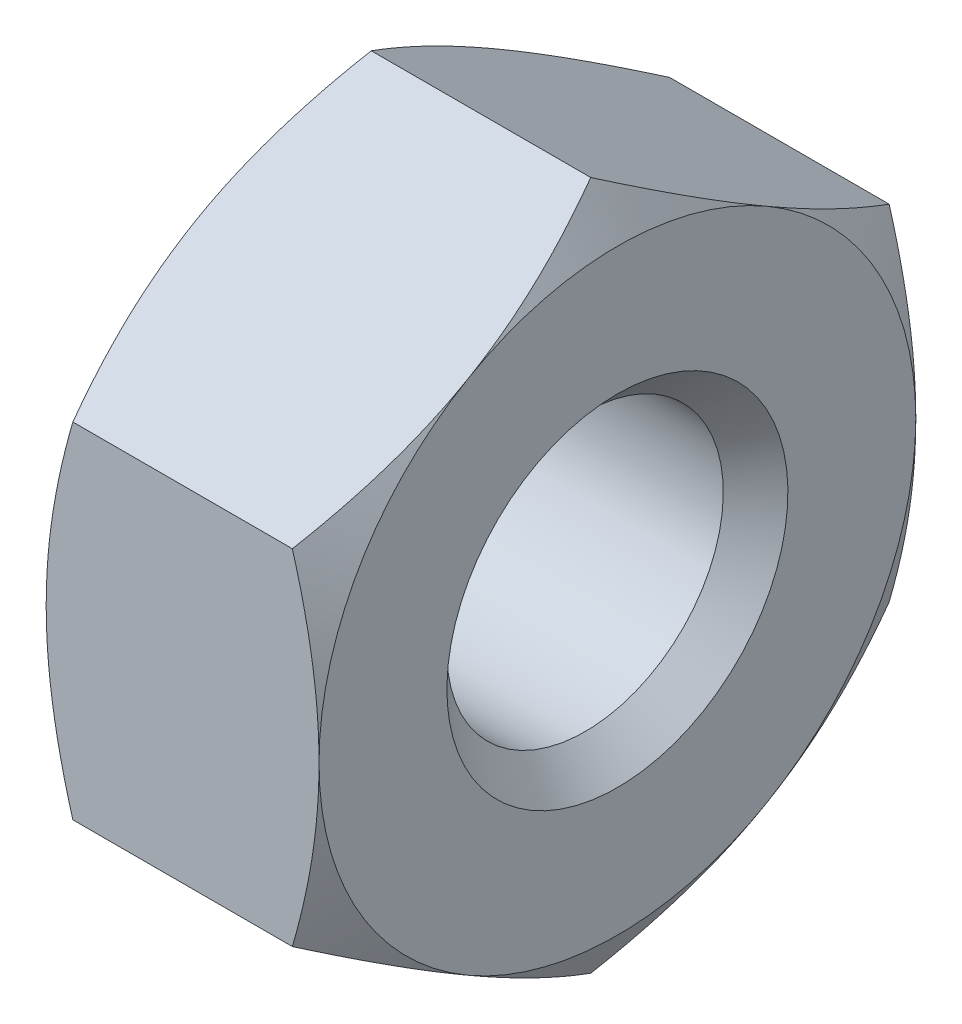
ISO-10303-21;
HEADER;
FILE_DESCRIPTION(('STEP AP214'),'2;1');
FILE_NAME('part.step','',(''),(''),'','','');
FILE_SCHEMA(('AUTOMOTIVE_DESIGN { 1 0 10303 214 1 1 1 1 }'));
ENDSEC;
DATA;
#1=APPLICATION_CONTEXT('core data for automotive mechanical design processes');
#2=APPLICATION_PROTOCOL_DEFINITION('international standard','automotive_design',2000,#1);
#3=PRODUCT_CONTEXT('',#1,'mechanical');
#4=PRODUCT('Part','Part','',(#3));
#5=PRODUCT_RELATED_PRODUCT_CATEGORY('part','',(#4));
#6=PRODUCT_DEFINITION_FORMATION('','',#4);
#7=PRODUCT_DEFINITION_CONTEXT('part definition',#1,'design');
#8=PRODUCT_DEFINITION('design','',#6,#7);
#9=PRODUCT_DEFINITION_SHAPE('','',#8);
#10=(LENGTH_UNIT() NAMED_UNIT(*) SI_UNIT(.MILLI.,.METRE.));
#11=(NAMED_UNIT(*) PLANE_ANGLE_UNIT() SI_UNIT($,.RADIAN.));
#12=(NAMED_UNIT(*) SI_UNIT($,.STERADIAN.) SOLID_ANGLE_UNIT());
#13=UNCERTAINTY_MEASURE_WITH_UNIT(LENGTH_MEASURE(1.E-05),#10,'distance_accuracy_value','');
#14=(GEOMETRIC_REPRESENTATION_CONTEXT(3) GLOBAL_UNCERTAINTY_ASSIGNED_CONTEXT((#13)) GLOBAL_UNIT_ASSIGNED_CONTEXT((#10,
#11,#12)) REPRESENTATION_CONTEXT('',''));
#15=CARTESIAN_POINT('',(0.,0.,0.));
#16=DIRECTION('',(0.,0.,1.));
#17=DIRECTION('',(1.,0.,0.));
#18=AXIS2_PLACEMENT_3D('',#15,#16,#17);
#19=DIRECTION('',(-0.707106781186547,0.707106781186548,0.));
#20=VECTOR('',#19,1.);
#21=CARTESIAN_POINT('',(-498998.,499000.,0.));
#22=LINE('',#21,#20);
#23=CARTESIAN_POINT('',(2.,0.,0.));
#24=DIRECTION('',(-1.,0.,0.));
#25=AXIS1_PLACEMENT('',#23,#24);
#26=SURFACE_OF_REVOLUTION('',#22,#25);
#27=CARTESIAN_POINT('',(0.379,0.,0.));
#28=DIRECTION('',(-1.,0.,0.));
#29=DIRECTION('',(0.,1.,0.));
#30=AXIS2_PLACEMENT_3D('',#27,#28,#29);
#31=CIRCLE('',#30,1.621);
#32=CARTESIAN_POINT('',(0.379,1.621,0.));
#33=VERTEX_POINT('',#32);
#34=EDGE_CURVE('E147',#33,#33,#31,.T.);
#35=ORIENTED_EDGE('',*,*,#34,.F.);
#36=EDGE_LOOP('',(#35));
#37=FACE_BOUND('',#36,.T.);
#38=CARTESIAN_POINT('',(0.,0.,0.));
#39=DIRECTION('',(-1.,0.,0.));
#40=DIRECTION('',(0.,1.,0.));
#41=AXIS2_PLACEMENT_3D('',#38,#39,#40);
#42=CIRCLE('',#41,2.);
#43=CARTESIAN_POINT('',(0.,2.,0.));
#44=VERTEX_POINT('',#43);
#45=EDGE_CURVE('E328',#44,#44,#42,.T.);
#46=ORIENTED_EDGE('',*,*,#45,.T.);
#47=EDGE_LOOP('',(#46));
#48=FACE_BOUND('',#47,.T.);
#49=ADVANCED_FACE('F17',(#37,#48),#26,.F.);
#50=CARTESIAN_POINT('',(0.,2.75,0.));
#51=DIRECTION('',(-1.,0.,0.));
#52=DIRECTION('',(0.,-1.,0.));
#53=AXIS2_PLACEMENT_3D('',#50,#51,#52);
#54=PLANE('',#53);
#55=CARTESIAN_POINT('',(0.,0.,0.));
#56=DIRECTION('',(-1.,0.,0.));
#57=DIRECTION('',(0.,1.,0.));
#58=AXIS2_PLACEMENT_3D('',#55,#56,#57);
#59=CIRCLE('',#58,3.5);
#60=CARTESIAN_POINT('',(0.,3.03108891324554,1.75));
#61=VERTEX_POINT('',#60);
#62=CARTESIAN_POINT('',(0.,3.03108891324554,-1.75));
#63=VERTEX_POINT('',#62);
#64=EDGE_CURVE('E11',#61,#63,#59,.T.);
#65=ORIENTED_EDGE('',*,*,#64,.T.);
#66=CARTESIAN_POINT('',(0.,0.,0.));
#67=DIRECTION('',(-1.,0.,0.));
#68=DIRECTION('',(0.,1.,0.));
#69=AXIS2_PLACEMENT_3D('',#66,#67,#68);
#70=CIRCLE('',#69,3.5);
#71=CARTESIAN_POINT('',(0.,0.,-3.5));
#72=VERTEX_POINT('',#71);
#73=EDGE_CURVE('E27',#63,#72,#70,.T.);
#74=ORIENTED_EDGE('',*,*,#73,.T.);
#75=CARTESIAN_POINT('',(0.,0.,0.));
#76=DIRECTION('',(-1.,0.,0.));
#77=DIRECTION('',(0.,1.,0.));
#78=AXIS2_PLACEMENT_3D('',#75,#76,#77);
#79=CIRCLE('',#78,3.5);
#80=CARTESIAN_POINT('',(0.,-3.03108891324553,-1.75));
#81=VERTEX_POINT('',#80);
#82=EDGE_CURVE('E163',#72,#81,#79,.T.);
#83=ORIENTED_EDGE('',*,*,#82,.T.);
#84=CARTESIAN_POINT('',(0.,0.,0.));
#85=DIRECTION('',(-1.,0.,0.));
#86=DIRECTION('',(0.,1.,0.));
#87=AXIS2_PLACEMENT_3D('',#84,#85,#86);
#88=CIRCLE('',#87,3.5);
#89=CARTESIAN_POINT('',(0.,-3.03108891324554,1.75));
#90=VERTEX_POINT('',#89);
#91=EDGE_CURVE('E169',#81,#90,#88,.T.);
#92=ORIENTED_EDGE('',*,*,#91,.T.);
#93=CARTESIAN_POINT('',(0.,0.,0.));
#94=DIRECTION('',(-1.,0.,0.));
#95=DIRECTION('',(0.,1.,0.));
#96=AXIS2_PLACEMENT_3D('',#93,#94,#95);
#97=CIRCLE('',#96,3.5);
#98=CARTESIAN_POINT('',(0.,0.,3.5));
#99=VERTEX_POINT('',#98);
#100=EDGE_CURVE('E383',#90,#99,#97,.T.);
#101=ORIENTED_EDGE('',*,*,#100,.T.);
#102=CARTESIAN_POINT('',(0.,0.,0.));
#103=DIRECTION('',(-1.,0.,0.));
#104=DIRECTION('',(0.,1.,0.));
#105=AXIS2_PLACEMENT_3D('',#102,#103,#104);
#106=CIRCLE('',#105,3.5);
#107=EDGE_CURVE('E356',#99,#61,#106,.T.);
#108=ORIENTED_EDGE('',*,*,#107,.T.);
#109=EDGE_LOOP('',(#65,#74,#83,#92,#101,#108));
#110=FACE_BOUND('',#109,.T.);
#111=ORIENTED_EDGE('',*,*,#45,.F.);
#112=EDGE_LOOP('',(#111));
#113=FACE_BOUND('',#112,.T.);
#114=ADVANCED_FACE('F193',(#110,#113),#54,.T.);
#115=CARTESIAN_POINT('',(3.2,2.75,0.));
#116=DIRECTION('',(1.,0.,0.));
#117=DIRECTION('',(0.,0.,-1.));
#118=AXIS2_PLACEMENT_3D('',#115,#116,#117);
#119=PLANE('',#118);
#120=CARTESIAN_POINT('',(3.2,0.,0.));
#121=DIRECTION('',(-1.,0.,0.));
#122=DIRECTION('',(0.,1.,0.));
#123=AXIS2_PLACEMENT_3D('',#120,#121,#122);
#124=CIRCLE('',#123,2.);
#125=CARTESIAN_POINT('',(3.2,2.,0.));
#126=VERTEX_POINT('',#125);
#127=EDGE_CURVE('E376',#126,#126,#124,.T.);
#128=ORIENTED_EDGE('',*,*,#127,.T.);
#129=EDGE_LOOP('',(#128));
#130=FACE_BOUND('',#129,.T.);
#131=CARTESIAN_POINT('',(3.2,0.,0.));
#132=DIRECTION('',(-1.,0.,0.));
#133=DIRECTION('',(0.,1.,0.));
#134=AXIS2_PLACEMENT_3D('',#131,#132,#133);
#135=CIRCLE('',#134,3.5);
#136=CARTESIAN_POINT('',(3.2,3.03108891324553,1.75));
#137=VERTEX_POINT('',#136);
#138=CARTESIAN_POINT('',(3.2,3.03108891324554,-1.75));
#139=VERTEX_POINT('',#138);
#140=EDGE_CURVE('E129',#137,#139,#135,.T.);
#141=ORIENTED_EDGE('',*,*,#140,.F.);
#142=CARTESIAN_POINT('',(3.2,0.,0.));
#143=DIRECTION('',(-1.,0.,0.));
#144=DIRECTION('',(0.,1.,0.));
#145=AXIS2_PLACEMENT_3D('',#142,#143,#144);
#146=CIRCLE('',#145,3.5);
#147=CARTESIAN_POINT('',(3.2,0.,3.5));
#148=VERTEX_POINT('',#147);
#149=EDGE_CURVE('E133',#148,#137,#146,.T.);
#150=ORIENTED_EDGE('',*,*,#149,.F.);
#151=CARTESIAN_POINT('',(3.2,0.,0.));
#152=DIRECTION('',(-1.,0.,0.));
#153=DIRECTION('',(0.,1.,0.));
#154=AXIS2_PLACEMENT_3D('',#151,#152,#153);
#155=CIRCLE('',#154,3.5);
#156=CARTESIAN_POINT('',(3.2,-3.03108891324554,1.75));
#157=VERTEX_POINT('',#156);
#158=EDGE_CURVE('E80',#157,#148,#155,.T.);
#159=ORIENTED_EDGE('',*,*,#158,.F.);
#160=CARTESIAN_POINT('',(3.2,0.,0.));
#161=DIRECTION('',(-1.,0.,0.));
#162=DIRECTION('',(0.,1.,0.));
#163=AXIS2_PLACEMENT_3D('',#160,#161,#162);
#164=CIRCLE('',#163,3.5);
#165=CARTESIAN_POINT('',(3.2,-3.03108891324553,-1.75));
#166=VERTEX_POINT('',#165);
#167=EDGE_CURVE('E86',#166,#157,#164,.T.);
#168=ORIENTED_EDGE('',*,*,#167,.F.);
#169=CARTESIAN_POINT('',(3.2,0.,0.));
#170=DIRECTION('',(-1.,0.,0.));
#171=DIRECTION('',(0.,1.,0.));
#172=AXIS2_PLACEMENT_3D('',#169,#170,#171);
#173=CIRCLE('',#172,3.5);
#174=CARTESIAN_POINT('',(3.2,0.,-3.5));
#175=VERTEX_POINT('',#174);
#176=EDGE_CURVE('E152',#175,#166,#173,.T.);
#177=ORIENTED_EDGE('',*,*,#176,.F.);
#178=CARTESIAN_POINT('',(3.2,0.,0.));
#179=DIRECTION('',(-1.,0.,0.));
#180=DIRECTION('',(0.,1.,0.));
#181=AXIS2_PLACEMENT_3D('',#178,#179,#180);
#182=CIRCLE('',#181,3.5);
#183=EDGE_CURVE('E408',#139,#175,#182,.T.);
#184=ORIENTED_EDGE('',*,*,#183,.F.);
#185=EDGE_LOOP('',(#141,#150,#159,#168,#177,#184));
#186=FACE_BOUND('',#185,.T.);
#187=ADVANCED_FACE('F197',(#130,#186),#119,.T.);
#188=DIRECTION('',(0.707106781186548,0.707106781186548,0.));
#189=VECTOR('',#188,1.);
#190=CARTESIAN_POINT('',(499000.,498998.8,0.));
#191=LINE('',#190,#189);
#192=CARTESIAN_POINT('',(1.2,0.,0.));
#193=DIRECTION('',(1.,0.,0.));
#194=AXIS1_PLACEMENT('',#192,#193);
#195=SURFACE_OF_REVOLUTION('',#191,#194);
#196=ORIENTED_EDGE('',*,*,#127,.F.);
#197=EDGE_LOOP('',(#196));
#198=FACE_BOUND('',#197,.T.);
#199=CARTESIAN_POINT('',(2.821,0.,0.));
#200=DIRECTION('',(-1.,0.,0.));
#201=DIRECTION('',(0.,1.,0.));
#202=AXIS2_PLACEMENT_3D('',#199,#200,#201);
#203=CIRCLE('',#202,1.621);
#204=CARTESIAN_POINT('',(2.821,1.621,0.));
#205=VERTEX_POINT('',#204);
#206=EDGE_CURVE('E341',#205,#205,#203,.T.);
#207=ORIENTED_EDGE('',*,*,#206,.T.);
#208=EDGE_LOOP('',(#207));
#209=FACE_BOUND('',#208,.T.);
#210=ADVANCED_FACE('F201',(#198,#209),#195,.F.);
#211=CARTESIAN_POINT('',(1.6,0.,0.));
#212=DIRECTION('',(1.,0.,0.));
#213=DIRECTION('',(0.,1.,0.));
#214=AXIS2_PLACEMENT_3D('',#211,#212,#213);
#215=CIRCLE('',#214,1.621);
#216=DIRECTION('',(-1.,0.,0.));
#217=VECTOR('',#216,1.);
#218=SURFACE_OF_LINEAR_EXTRUSION('',#215,#217);
#219=ORIENTED_EDGE('',*,*,#206,.F.);
#220=EDGE_LOOP('',(#219));
#221=FACE_BOUND('',#220,.T.);
#222=ORIENTED_EDGE('',*,*,#34,.T.);
#223=EDGE_LOOP('',(#222));
#224=FACE_BOUND('',#223,.T.);
#225=ADVANCED_FACE('F205',(#221,#224),#218,.T.);
#226=DIRECTION('',(0.5,-0.866025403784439,0.));
#227=VECTOR('',#226,1.);
#228=CARTESIAN_POINT('',(-288092.563599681,499000.,0.));
#229=LINE('',#228,#227);
#230=CARTESIAN_POINT('',(5.22072594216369,0.,0.));
#231=DIRECTION('',(-1.,0.,0.));
#232=AXIS1_PLACEMENT('',#230,#231);
#233=SURFACE_OF_REVOLUTION('',#229,#232);
#234=CARTESIAN_POINT('',(3.2,3.03108891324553,1.75));
#235=CARTESIAN_POINT('',(3.2,2.5621778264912,2.56217782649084));
#236=CARTESIAN_POINT('',(2.88739260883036,2.02072594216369,3.5));
#237=(BOUNDED_CURVE() B_SPLINE_CURVE(2,(#234,#235,#236),.UNSPECIFIED.,.F.,
.F.) B_SPLINE_CURVE_WITH_KNOTS((3,3),(5.47756078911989,8.00558104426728),
.UNSPECIFIED.) CURVE() GEOMETRIC_REPRESENTATION_ITEM() RATIONAL_B_SPLINE_CURVE((1.,
1.08375764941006,1.09020313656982)) REPRESENTATION_ITEM(''));
#238=CARTESIAN_POINT('',(2.88739260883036,2.02072594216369,3.5));
#239=VERTEX_POINT('',#238);
#240=EDGE_CURVE('E125',#137,#239,#237,.T.);
#241=ORIENTED_EDGE('',*,*,#240,.T.);
#242=CARTESIAN_POINT('',(2.88739260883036,2.02072594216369,3.5));
#243=CARTESIAN_POINT('',(3.2,0.937822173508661,3.5));
#244=CARTESIAN_POINT('',(3.2,0.,3.5));
#245=(BOUNDED_CURVE() B_SPLINE_CURVE(2,(#242,#243,#244),.UNSPECIFIED.,.F.,
.F.) B_SPLINE_CURVE_WITH_KNOTS((3,3),(2.94954053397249,5.47756078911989),
.UNSPECIFIED.) CURVE() GEOMETRIC_REPRESENTATION_ITEM() RATIONAL_B_SPLINE_CURVE((1.09020313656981,
1.08375764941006,1.)) REPRESENTATION_ITEM(''));
#246=EDGE_CURVE('E135',#239,#148,#245,.T.);
#247=ORIENTED_EDGE('',*,*,#246,.T.);
#248=ORIENTED_EDGE('',*,*,#149,.T.);
#249=EDGE_LOOP('',(#241,#247,#248));
#250=FACE_BOUND('',#249,.T.);
#251=ADVANCED_FACE('F209',(#250),#233,.F.);
#252=DIRECTION('',(0.5,-0.866025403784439,0.));
#253=VECTOR('',#252,1.);
#254=CARTESIAN_POINT('',(-288092.563599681,499000.,0.));
#255=LINE('',#254,#253);
#256=CARTESIAN_POINT('',(5.22072594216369,0.,0.));
#257=DIRECTION('',(-1.,0.,0.));
#258=AXIS1_PLACEMENT('',#256,#257);
#259=SURFACE_OF_REVOLUTION('',#255,#258);
#260=CARTESIAN_POINT('',(3.2,3.03108891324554,-1.75));
#261=CARTESIAN_POINT('',(3.2,3.49999999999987,-0.93782217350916));
#262=CARTESIAN_POINT('',(2.88739260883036,4.04145188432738,0.));
#263=(BOUNDED_CURVE() B_SPLINE_CURVE(2,(#260,#261,#262),.UNSPECIFIED.,.F.,
.F.) B_SPLINE_CURVE_WITH_KNOTS((3,3),(5.47756078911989,8.00558104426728),
.UNSPECIFIED.) CURVE() GEOMETRIC_REPRESENTATION_ITEM() RATIONAL_B_SPLINE_CURVE((1.,
1.08375764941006,1.09020313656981)) REPRESENTATION_ITEM(''));
#264=CARTESIAN_POINT('',(2.88739260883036,4.04145188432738,0.));
#265=VERTEX_POINT('',#264);
#266=EDGE_CURVE('E111',#139,#265,#263,.T.);
#267=ORIENTED_EDGE('',*,*,#266,.T.);
#268=CARTESIAN_POINT('',(2.88739260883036,4.04145188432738,0.));
#269=CARTESIAN_POINT('',(3.2,3.49999999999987,0.937822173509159));
#270=CARTESIAN_POINT('',(3.2,3.03108891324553,1.75));
#271=(BOUNDED_CURVE() B_SPLINE_CURVE(2,(#268,#269,#270),.UNSPECIFIED.,.F.,
.F.) B_SPLINE_CURVE_WITH_KNOTS((3,3),(2.94954053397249,5.47756078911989),
.UNSPECIFIED.) CURVE() GEOMETRIC_REPRESENTATION_ITEM() RATIONAL_B_SPLINE_CURVE((1.09020313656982,
1.08375764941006,1.)) REPRESENTATION_ITEM(''));
#272=EDGE_CURVE('E121',#265,#137,#271,.T.);
#273=ORIENTED_EDGE('',*,*,#272,.T.);
#274=ORIENTED_EDGE('',*,*,#140,.T.);
#275=EDGE_LOOP('',(#267,#273,#274));
#276=FACE_BOUND('',#275,.T.);
#277=ADVANCED_FACE('F131',(#276),#259,.F.);
#278=DIRECTION('',(0.5,-0.866025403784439,0.));
#279=VECTOR('',#278,1.);
#280=CARTESIAN_POINT('',(-288092.563599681,499000.,0.));
#281=LINE('',#280,#279);
#282=CARTESIAN_POINT('',(5.22072594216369,0.,0.));
#283=DIRECTION('',(-1.,0.,0.));
#284=AXIS1_PLACEMENT('',#282,#283);
#285=SURFACE_OF_REVOLUTION('',#281,#284);
#286=CARTESIAN_POINT('',(3.2,0.,-3.5));
#287=CARTESIAN_POINT('',(3.2,0.93782217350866,-3.5));
#288=CARTESIAN_POINT('',(2.88739260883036,2.02072594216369,-3.5));
#289=(BOUNDED_CURVE() B_SPLINE_CURVE(2,(#286,#287,#288),.UNSPECIFIED.,.F.,
.F.) B_SPLINE_CURVE_WITH_KNOTS((3,3),(5.47756078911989,8.00558104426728),
.UNSPECIFIED.) CURVE() GEOMETRIC_REPRESENTATION_ITEM() RATIONAL_B_SPLINE_CURVE((1.,
1.08375764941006,1.09020313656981)) REPRESENTATION_ITEM(''));
#290=CARTESIAN_POINT('',(2.88739260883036,2.02072594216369,-3.5));
#291=VERTEX_POINT('',#290);
#292=EDGE_CURVE('E409',#175,#291,#289,.T.);
#293=ORIENTED_EDGE('',*,*,#292,.T.);
#294=CARTESIAN_POINT('',(2.88739260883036,2.02072594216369,-3.5));
#295=CARTESIAN_POINT('',(3.2,2.56217782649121,-2.56217782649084));
#296=CARTESIAN_POINT('',(3.2,3.03108891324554,-1.75));
#297=(BOUNDED_CURVE() B_SPLINE_CURVE(2,(#294,#295,#296),.UNSPECIFIED.,.F.,
.F.) B_SPLINE_CURVE_WITH_KNOTS((3,3),(2.94954053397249,5.47756078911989),
.UNSPECIFIED.) CURVE() GEOMETRIC_REPRESENTATION_ITEM() RATIONAL_B_SPLINE_CURVE((1.09020313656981,
1.08375764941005,1.)) REPRESENTATION_ITEM(''));
#298=EDGE_CURVE('E103',#291,#139,#297,.T.);
#299=ORIENTED_EDGE('',*,*,#298,.T.);
#300=ORIENTED_EDGE('',*,*,#183,.T.);
#301=EDGE_LOOP('',(#293,#299,#300));
#302=FACE_BOUND('',#301,.T.);
#303=ADVANCED_FACE('F222',(#302),#285,.F.);
#304=DIRECTION('',(0.5,-0.866025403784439,0.));
#305=VECTOR('',#304,1.);
#306=CARTESIAN_POINT('',(-288092.563599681,499000.,0.));
#307=LINE('',#306,#305);
#308=CARTESIAN_POINT('',(5.22072594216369,0.,0.));
#309=DIRECTION('',(-1.,0.,0.));
#310=AXIS1_PLACEMENT('',#308,#309);
#311=SURFACE_OF_REVOLUTION('',#307,#310);
#312=CARTESIAN_POINT('',(2.88739260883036,-2.02072594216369,-3.5));
#313=CARTESIAN_POINT('',(3.2,-0.937822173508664,-3.5));
#314=CARTESIAN_POINT('',(3.2,0.,-3.5));
#315=(BOUNDED_CURVE() B_SPLINE_CURVE(2,(#312,#313,#314),.UNSPECIFIED.,.F.,
.F.) B_SPLINE_CURVE_WITH_KNOTS((3,3),(2.94954053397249,5.47756078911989),
.UNSPECIFIED.) CURVE() GEOMETRIC_REPRESENTATION_ITEM() RATIONAL_B_SPLINE_CURVE((1.09020313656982,
1.08375764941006,1.)) REPRESENTATION_ITEM(''));
#316=CARTESIAN_POINT('',(2.88739260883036,-2.02072594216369,-3.5));
#317=VERTEX_POINT('',#316);
#318=EDGE_CURVE('E401',#317,#175,#315,.T.);
#319=ORIENTED_EDGE('',*,*,#318,.T.);
#320=ORIENTED_EDGE('',*,*,#176,.T.);
#321=CARTESIAN_POINT('',(3.2,-3.03108891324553,-1.75));
#322=CARTESIAN_POINT('',(3.2,-2.5621778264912,-2.56217782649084));
#323=CARTESIAN_POINT('',(2.88739260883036,-2.02072594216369,-3.5));
#324=(BOUNDED_CURVE() B_SPLINE_CURVE(2,(#321,#322,#323),.UNSPECIFIED.,.F.,
.F.) B_SPLINE_CURVE_WITH_KNOTS((3,3),(5.47756078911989,8.00558104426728),
.UNSPECIFIED.) CURVE() GEOMETRIC_REPRESENTATION_ITEM() RATIONAL_B_SPLINE_CURVE((1.,
1.08375764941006,1.09020313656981)) REPRESENTATION_ITEM(''));
#325=EDGE_CURVE('E148',#166,#317,#324,.T.);
#326=ORIENTED_EDGE('',*,*,#325,.T.);
#327=EDGE_LOOP('',(#319,#320,#326));
#328=FACE_BOUND('',#327,.T.);
#329=ADVANCED_FACE('F225',(#328),#311,.F.);
#330=DIRECTION('',(0.5,-0.866025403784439,0.));
#331=VECTOR('',#330,1.);
#332=CARTESIAN_POINT('',(-288092.563599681,499000.,0.));
#333=LINE('',#332,#331);
#334=CARTESIAN_POINT('',(5.22072594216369,0.,0.));
#335=DIRECTION('',(-1.,0.,0.));
#336=AXIS1_PLACEMENT('',#334,#335);
#337=SURFACE_OF_REVOLUTION('',#333,#336);
#338=CARTESIAN_POINT('',(2.88739260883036,-4.04145188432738,0.));
#339=CARTESIAN_POINT('',(3.2,-3.49999999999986,-0.937822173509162));
#340=CARTESIAN_POINT('',(3.2,-3.03108891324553,-1.75));
#341=(BOUNDED_CURVE() B_SPLINE_CURVE(2,(#338,#339,#340),.UNSPECIFIED.,.F.,
.F.) B_SPLINE_CURVE_WITH_KNOTS((3,3),(2.9495405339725,5.47756078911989),
.UNSPECIFIED.) CURVE() GEOMETRIC_REPRESENTATION_ITEM() RATIONAL_B_SPLINE_CURVE((1.09020313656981,
1.08375764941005,1.)) REPRESENTATION_ITEM(''));
#342=CARTESIAN_POINT('',(2.88739260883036,-4.04145188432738,0.));
#343=VERTEX_POINT('',#342);
#344=EDGE_CURVE('E153',#343,#166,#341,.T.);
#345=ORIENTED_EDGE('',*,*,#344,.T.);
#346=ORIENTED_EDGE('',*,*,#167,.T.);
#347=CARTESIAN_POINT('',(3.2,-3.03108891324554,1.75));
#348=CARTESIAN_POINT('',(3.2,-3.49999999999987,0.937822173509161));
#349=CARTESIAN_POINT('',(2.88739260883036,-4.04145188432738,0.));
#350=(BOUNDED_CURVE() B_SPLINE_CURVE(2,(#347,#348,#349),.UNSPECIFIED.,.F.,
.F.) B_SPLINE_CURVE_WITH_KNOTS((3,3),(5.47756078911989,8.00558104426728),
.UNSPECIFIED.) CURVE() GEOMETRIC_REPRESENTATION_ITEM() RATIONAL_B_SPLINE_CURVE((1.,
1.08375764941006,1.09020313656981)) REPRESENTATION_ITEM(''));
#351=EDGE_CURVE('E162',#157,#343,#350,.T.);
#352=ORIENTED_EDGE('',*,*,#351,.T.);
#353=EDGE_LOOP('',(#345,#346,#352));
#354=FACE_BOUND('',#353,.T.);
#355=ADVANCED_FACE('F229',(#354),#337,.F.);
#356=DIRECTION('',(0.5,-0.866025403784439,0.));
#357=VECTOR('',#356,1.);
#358=CARTESIAN_POINT('',(-288092.563599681,499000.,0.));
#359=LINE('',#358,#357);
#360=CARTESIAN_POINT('',(5.22072594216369,0.,0.));
#361=DIRECTION('',(-1.,0.,0.));
#362=AXIS1_PLACEMENT('',#360,#361);
#363=SURFACE_OF_REVOLUTION('',#359,#362);
#364=CARTESIAN_POINT('',(2.88739260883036,-2.02072594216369,3.5));
#365=CARTESIAN_POINT('',(3.2,-2.5621778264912,2.56217782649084));
#366=CARTESIAN_POINT('',(3.2,-3.03108891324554,1.75));
#367=(BOUNDED_CURVE() B_SPLINE_CURVE(2,(#364,#365,#366),.UNSPECIFIED.,.F.,
.F.) B_SPLINE_CURVE_WITH_KNOTS((3,3),(2.94954053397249,5.47756078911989),
.UNSPECIFIED.) CURVE() GEOMETRIC_REPRESENTATION_ITEM() RATIONAL_B_SPLINE_CURVE((1.09020313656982,
1.08375764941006,1.)) REPRESENTATION_ITEM(''));
#368=CARTESIAN_POINT('',(2.88739260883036,-2.02072594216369,3.5));
#369=VERTEX_POINT('',#368);
#370=EDGE_CURVE('E154',#369,#157,#367,.T.);
#371=ORIENTED_EDGE('',*,*,#370,.T.);
#372=ORIENTED_EDGE('',*,*,#158,.T.);
#373=CARTESIAN_POINT('',(3.2,0.,3.5));
#374=CARTESIAN_POINT('',(3.2,-0.937822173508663,3.5));
#375=CARTESIAN_POINT('',(2.88739260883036,-2.02072594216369,3.5));
#376=(BOUNDED_CURVE() B_SPLINE_CURVE(2,(#373,#374,#375),.UNSPECIFIED.,.F.,
.F.) B_SPLINE_CURVE_WITH_KNOTS((3,3),(5.47756078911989,8.00558104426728),
.UNSPECIFIED.) CURVE() GEOMETRIC_REPRESENTATION_ITEM() RATIONAL_B_SPLINE_CURVE((1.,
1.08375764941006,1.09020313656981)) REPRESENTATION_ITEM(''));
#377=EDGE_CURVE('E429',#148,#369,#376,.T.);
#378=ORIENTED_EDGE('',*,*,#377,.T.);
#379=EDGE_LOOP('',(#371,#372,#378));
#380=FACE_BOUND('',#379,.T.);
#381=ADVANCED_FACE('F240',(#380),#363,.F.);
#382=DIRECTION('',(-0.5,-0.866025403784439,0.));
#383=VECTOR('',#382,1.);
#384=CARTESIAN_POINT('',(288095.763599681,499000.,0.));
#385=LINE('',#384,#383);
#386=CARTESIAN_POINT('',(-2.02072594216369,0.,0.));
#387=DIRECTION('',(1.,0.,0.));
#388=AXIS1_PLACEMENT('',#386,#387);
#389=SURFACE_OF_REVOLUTION('',#385,#388);
#390=CARTESIAN_POINT('',(0.,3.03108891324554,1.75));
#391=CARTESIAN_POINT('',(0.,3.49999999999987,0.937822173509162));
#392=CARTESIAN_POINT('',(0.312607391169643,4.04145188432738,0.));
#393=(BOUNDED_CURVE() B_SPLINE_CURVE(2,(#390,#391,#392),.UNSPECIFIED.,.F.,
.F.) B_SPLINE_CURVE_WITH_KNOTS((3,3),(5.47756078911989,8.00558104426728),
.UNSPECIFIED.) CURVE() GEOMETRIC_REPRESENTATION_ITEM() RATIONAL_B_SPLINE_CURVE((1.,
1.08375764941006,1.09020313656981)) REPRESENTATION_ITEM(''));
#394=CARTESIAN_POINT('',(0.312607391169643,4.04145188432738,0.));
#395=VERTEX_POINT('',#394);
#396=EDGE_CURVE('E326',#61,#395,#393,.T.);
#397=ORIENTED_EDGE('',*,*,#396,.T.);
#398=CARTESIAN_POINT('',(0.312607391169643,4.04145188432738,0.));
#399=CARTESIAN_POINT('',(0.,3.49999999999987,-0.937822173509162));
#400=CARTESIAN_POINT('',(0.,3.03108891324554,-1.75));
#401=(BOUNDED_CURVE() B_SPLINE_CURVE(2,(#398,#399,#400),.UNSPECIFIED.,.F.,
.F.) B_SPLINE_CURVE_WITH_KNOTS((3,3),(2.9495405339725,5.47756078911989),
.UNSPECIFIED.) CURVE() GEOMETRIC_REPRESENTATION_ITEM() RATIONAL_B_SPLINE_CURVE((1.09020313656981,
1.08375764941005,1.)) REPRESENTATION_ITEM(''));
#402=EDGE_CURVE('E112',#395,#63,#401,.T.);
#403=ORIENTED_EDGE('',*,*,#402,.T.);
#404=ORIENTED_EDGE('',*,*,#64,.F.);
#405=EDGE_LOOP('',(#397,#403,#404));
#406=FACE_BOUND('',#405,.T.);
#407=ADVANCED_FACE('F243',(#406),#389,.F.);
#408=DIRECTION('',(-0.5,-0.866025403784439,0.));
#409=VECTOR('',#408,1.);
#410=CARTESIAN_POINT('',(288095.763599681,499000.,0.));
#411=LINE('',#410,#409);
#412=CARTESIAN_POINT('',(-2.02072594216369,0.,0.));
#413=DIRECTION('',(1.,0.,0.));
#414=AXIS1_PLACEMENT('',#412,#413);
#415=SURFACE_OF_REVOLUTION('',#411,#414);
#416=CARTESIAN_POINT('',(0.,0.,3.5));
#417=CARTESIAN_POINT('',(0.,0.937822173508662,3.5));
#418=CARTESIAN_POINT('',(0.312607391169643,2.02072594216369,3.5));
#419=(BOUNDED_CURVE() B_SPLINE_CURVE(2,(#416,#417,#418),.UNSPECIFIED.,.F.,
.F.) B_SPLINE_CURVE_WITH_KNOTS((3,3),(5.47756078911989,8.00558104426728),
.UNSPECIFIED.) CURVE() GEOMETRIC_REPRESENTATION_ITEM() RATIONAL_B_SPLINE_CURVE((1.,
1.08375764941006,1.09020313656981)) REPRESENTATION_ITEM(''));
#420=CARTESIAN_POINT('',(0.312607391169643,2.02072594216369,3.5));
#421=VERTEX_POINT('',#420);
#422=EDGE_CURVE('E327',#99,#421,#419,.T.);
#423=ORIENTED_EDGE('',*,*,#422,.T.);
#424=CARTESIAN_POINT('',(0.312607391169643,2.02072594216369,3.5));
#425=CARTESIAN_POINT('',(0.,2.5621778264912,2.56217782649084));
#426=CARTESIAN_POINT('',(0.,3.03108891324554,1.75));
#427=(BOUNDED_CURVE() B_SPLINE_CURVE(2,(#424,#425,#426),.UNSPECIFIED.,.F.,
.F.) B_SPLINE_CURVE_WITH_KNOTS((3,3),(2.9495405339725,5.47756078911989),
.UNSPECIFIED.) CURVE() GEOMETRIC_REPRESENTATION_ITEM() RATIONAL_B_SPLINE_CURVE((1.09020313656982,
1.08375764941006,1.)) REPRESENTATION_ITEM(''));
#428=EDGE_CURVE('E351',#421,#61,#427,.T.);
#429=ORIENTED_EDGE('',*,*,#428,.T.);
#430=ORIENTED_EDGE('',*,*,#107,.F.);
#431=EDGE_LOOP('',(#423,#429,#430));
#432=FACE_BOUND('',#431,.T.);
#433=ADVANCED_FACE('F247',(#432),#415,.F.);
#434=DIRECTION('',(-0.5,-0.866025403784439,0.));
#435=VECTOR('',#434,1.);
#436=CARTESIAN_POINT('',(288095.763599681,499000.,0.));
#437=LINE('',#436,#435);
#438=CARTESIAN_POINT('',(-2.02072594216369,0.,0.));
#439=DIRECTION('',(1.,0.,0.));
#440=AXIS1_PLACEMENT('',#438,#439);
#441=SURFACE_OF_REVOLUTION('',#437,#440);
#442=CARTESIAN_POINT('',(0.,-3.03108891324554,1.75));
#443=CARTESIAN_POINT('',(0.,-2.5621778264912,2.56217782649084));
#444=CARTESIAN_POINT('',(0.312607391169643,-2.02072594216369,3.5));
#445=(BOUNDED_CURVE() B_SPLINE_CURVE(2,(#442,#443,#444),.UNSPECIFIED.,.F.,
.F.) B_SPLINE_CURVE_WITH_KNOTS((3,3),(5.47756078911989,8.00558104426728),
.UNSPECIFIED.) CURVE() GEOMETRIC_REPRESENTATION_ITEM() RATIONAL_B_SPLINE_CURVE((1.,
1.08375764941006,1.09020313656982)) REPRESENTATION_ITEM(''));
#446=CARTESIAN_POINT('',(0.312607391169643,-2.02072594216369,3.5));
#447=VERTEX_POINT('',#446);
#448=EDGE_CURVE('E296',#90,#447,#445,.T.);
#449=ORIENTED_EDGE('',*,*,#448,.T.);
#450=CARTESIAN_POINT('',(0.312607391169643,-2.02072594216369,3.5));
#451=CARTESIAN_POINT('',(0.,-0.937822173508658,3.5));
#452=CARTESIAN_POINT('',(0.,0.,3.5));
#453=(BOUNDED_CURVE() B_SPLINE_CURVE(2,(#450,#451,#452),.UNSPECIFIED.,.F.,
.F.) B_SPLINE_CURVE_WITH_KNOTS((3,3),(2.9495405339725,5.47756078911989),
.UNSPECIFIED.) CURVE() GEOMETRIC_REPRESENTATION_ITEM() RATIONAL_B_SPLINE_CURVE((1.09020313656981,
1.08375764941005,1.)) REPRESENTATION_ITEM(''));
#454=EDGE_CURVE('E181',#447,#99,#453,.T.);
#455=ORIENTED_EDGE('',*,*,#454,.T.);
#456=ORIENTED_EDGE('',*,*,#100,.F.);
#457=EDGE_LOOP('',(#449,#455,#456));
#458=FACE_BOUND('',#457,.T.);
#459=ADVANCED_FACE('F251',(#458),#441,.F.);
#460=DIRECTION('',(-0.5,-0.866025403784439,0.));
#461=VECTOR('',#460,1.);
#462=CARTESIAN_POINT('',(288095.763599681,499000.,0.));
#463=LINE('',#462,#461);
#464=CARTESIAN_POINT('',(-2.02072594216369,0.,0.));
#465=DIRECTION('',(1.,0.,0.));
#466=AXIS1_PLACEMENT('',#464,#465);
#467=SURFACE_OF_REVOLUTION('',#463,#466);
#468=CARTESIAN_POINT('',(0.312607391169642,-4.04145188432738,0.));
#469=CARTESIAN_POINT('',(0.,-3.49999999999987,0.937822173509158));
#470=CARTESIAN_POINT('',(0.,-3.03108891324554,1.75));
#471=(BOUNDED_CURVE() B_SPLINE_CURVE(2,(#468,#469,#470),.UNSPECIFIED.,.F.,
.F.) B_SPLINE_CURVE_WITH_KNOTS((3,3),(2.9495405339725,5.47756078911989),
.UNSPECIFIED.) CURVE() GEOMETRIC_REPRESENTATION_ITEM() RATIONAL_B_SPLINE_CURVE((1.09020313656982,
1.08375764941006,1.)) REPRESENTATION_ITEM(''));
#472=CARTESIAN_POINT('',(0.312607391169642,-4.04145188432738,0.));
#473=VERTEX_POINT('',#472);
#474=EDGE_CURVE('E176',#473,#90,#471,.T.);
#475=ORIENTED_EDGE('',*,*,#474,.T.);
#476=ORIENTED_EDGE('',*,*,#91,.F.);
#477=CARTESIAN_POINT('',(0.,-3.03108891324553,-1.75));
#478=CARTESIAN_POINT('',(0.,-3.49999999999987,-0.937822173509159));
#479=CARTESIAN_POINT('',(0.312607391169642,-4.04145188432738,0.));
#480=(BOUNDED_CURVE() B_SPLINE_CURVE(2,(#477,#478,#479),.UNSPECIFIED.,.F.,
.F.) B_SPLINE_CURVE_WITH_KNOTS((3,3),(5.47756078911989,8.00558104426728),
.UNSPECIFIED.) CURVE() GEOMETRIC_REPRESENTATION_ITEM() RATIONAL_B_SPLINE_CURVE((1.,
1.08375764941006,1.09020313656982)) REPRESENTATION_ITEM(''));
#481=EDGE_CURVE('E182',#81,#473,#480,.T.);
#482=ORIENTED_EDGE('',*,*,#481,.T.);
#483=EDGE_LOOP('',(#475,#476,#482));
#484=FACE_BOUND('',#483,.T.);
#485=ADVANCED_FACE('F260',(#484),#467,.F.);
#486=DIRECTION('',(-0.5,-0.866025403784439,0.));
#487=VECTOR('',#486,1.);
#488=CARTESIAN_POINT('',(288095.763599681,499000.,0.));
#489=LINE('',#488,#487);
#490=CARTESIAN_POINT('',(-2.02072594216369,0.,0.));
#491=DIRECTION('',(1.,0.,0.));
#492=AXIS1_PLACEMENT('',#490,#491);
#493=SURFACE_OF_REVOLUTION('',#489,#492);
#494=CARTESIAN_POINT('',(0.312607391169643,-2.02072594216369,-3.5));
#495=CARTESIAN_POINT('',(0.,-2.5621778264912,-2.56217782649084));
#496=CARTESIAN_POINT('',(0.,-3.03108891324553,-1.75));
#497=(BOUNDED_CURVE() B_SPLINE_CURVE(2,(#494,#495,#496),.UNSPECIFIED.,.F.,
.F.) B_SPLINE_CURVE_WITH_KNOTS((3,3),(2.94954053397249,5.47756078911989),
.UNSPECIFIED.) CURVE() GEOMETRIC_REPRESENTATION_ITEM() RATIONAL_B_SPLINE_CURVE((1.09020313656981,
1.08375764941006,1.)) REPRESENTATION_ITEM(''));
#498=CARTESIAN_POINT('',(0.312607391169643,-2.02072594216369,-3.5));
#499=VERTEX_POINT('',#498);
#500=EDGE_CURVE('E303',#499,#81,#497,.T.);
#501=ORIENTED_EDGE('',*,*,#500,.T.);
#502=ORIENTED_EDGE('',*,*,#82,.F.);
#503=CARTESIAN_POINT('',(0.,0.,-3.5));
#504=CARTESIAN_POINT('',(0.,-0.93782217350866,-3.5));
#505=CARTESIAN_POINT('',(0.312607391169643,-2.02072594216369,-3.5));
#506=(BOUNDED_CURVE() B_SPLINE_CURVE(2,(#503,#504,#505),.UNSPECIFIED.,.F.,
.F.) B_SPLINE_CURVE_WITH_KNOTS((3,3),(5.47756078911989,8.00558104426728),
.UNSPECIFIED.) CURVE() GEOMETRIC_REPRESENTATION_ITEM() RATIONAL_B_SPLINE_CURVE((1.,
1.08375764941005,1.09020313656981)) REPRESENTATION_ITEM(''));
#507=EDGE_CURVE('E305',#72,#499,#506,.T.);
#508=ORIENTED_EDGE('',*,*,#507,.T.);
#509=EDGE_LOOP('',(#501,#502,#508));
#510=FACE_BOUND('',#509,.T.);
#511=ADVANCED_FACE('F263',(#510),#493,.F.);
#512=DIRECTION('',(-0.5,-0.866025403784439,0.));
#513=VECTOR('',#512,1.);
#514=CARTESIAN_POINT('',(288095.763599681,499000.,0.));
#515=LINE('',#514,#513);
#516=CARTESIAN_POINT('',(-2.02072594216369,0.,0.));
#517=DIRECTION('',(1.,0.,0.));
#518=AXIS1_PLACEMENT('',#516,#517);
#519=SURFACE_OF_REVOLUTION('',#515,#518);
#520=CARTESIAN_POINT('',(0.312607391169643,2.02072594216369,-3.5));
#521=CARTESIAN_POINT('',(0.,0.937822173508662,-3.5));
#522=CARTESIAN_POINT('',(0.,0.,-3.5));
#523=(BOUNDED_CURVE() B_SPLINE_CURVE(2,(#520,#521,#522),.UNSPECIFIED.,.F.,
.F.) B_SPLINE_CURVE_WITH_KNOTS((3,3),(2.9495405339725,5.47756078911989),
.UNSPECIFIED.) CURVE() GEOMETRIC_REPRESENTATION_ITEM() RATIONAL_B_SPLINE_CURVE((1.09020313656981,
1.08375764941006,1.)) REPRESENTATION_ITEM(''));
#524=CARTESIAN_POINT('',(0.312607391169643,2.02072594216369,-3.5));
#525=VERTEX_POINT('',#524);
#526=EDGE_CURVE('E313',#525,#72,#523,.T.);
#527=ORIENTED_EDGE('',*,*,#526,.T.);
#528=ORIENTED_EDGE('',*,*,#73,.F.);
#529=CARTESIAN_POINT('',(0.,3.03108891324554,-1.75));
#530=CARTESIAN_POINT('',(0.,2.5621778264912,-2.56217782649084));
#531=CARTESIAN_POINT('',(0.312607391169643,2.02072594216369,-3.5));
#532=(BOUNDED_CURVE() B_SPLINE_CURVE(2,(#529,#530,#531),.UNSPECIFIED.,.F.,
.F.) B_SPLINE_CURVE_WITH_KNOTS((3,3),(5.47756078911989,8.00558104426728),
.UNSPECIFIED.) CURVE() GEOMETRIC_REPRESENTATION_ITEM() RATIONAL_B_SPLINE_CURVE((1.,
1.08375764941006,1.09020313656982)) REPRESENTATION_ITEM(''));
#533=EDGE_CURVE('E36',#63,#525,#532,.T.);
#534=ORIENTED_EDGE('',*,*,#533,.T.);
#535=EDGE_LOOP('',(#527,#528,#534));
#536=FACE_BOUND('',#535,.T.);
#537=ADVANCED_FACE('F267',(#536),#519,.F.);
#538=CARTESIAN_POINT('',(4.2,-2.02072594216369,-3.5));
#539=DIRECTION('',(0.,-0.866025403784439,-0.5));
#540=DIRECTION('',(0.,0.5,-0.866025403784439));
#541=AXIS2_PLACEMENT_3D('',#538,#539,#540);
#542=PLANE('',#541);
#543=ORIENTED_EDGE('',*,*,#481,.F.);
#544=ORIENTED_EDGE('',*,*,#500,.F.);
#545=DIRECTION('',(-1.,0.,0.));
#546=VECTOR('',#545,1.);
#547=CARTESIAN_POINT('',(4.2,-2.02072594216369,-3.5));
#548=LINE('',#547,#546);
#549=EDGE_CURVE('E170',#317,#499,#548,.T.);
#550=ORIENTED_EDGE('',*,*,#549,.F.);
#551=ORIENTED_EDGE('',*,*,#325,.F.);
#552=ORIENTED_EDGE('',*,*,#344,.F.);
#553=DIRECTION('',(-1.,0.,0.));
#554=VECTOR('',#553,1.);
#555=CARTESIAN_POINT('',(4.2,-4.04145188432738,0.));
#556=LINE('',#555,#554);
#557=EDGE_CURVE('E173',#343,#473,#556,.T.);
#558=ORIENTED_EDGE('',*,*,#557,.T.);
#559=EDGE_LOOP('',(#543,#544,#550,#551,#552,#558));
#560=FACE_BOUND('',#559,.T.);
#561=ADVANCED_FACE('F271',(#560),#542,.T.);
#562=CARTESIAN_POINT('',(4.2,2.02072594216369,-3.5));
#563=DIRECTION('',(0.,0.,-1.));
#564=DIRECTION('',(-1.,0.,0.));
#565=AXIS2_PLACEMENT_3D('',#562,#563,#564);
#566=PLANE('',#565);
#567=ORIENTED_EDGE('',*,*,#507,.F.);
#568=ORIENTED_EDGE('',*,*,#526,.F.);
#569=DIRECTION('',(-1.,0.,0.));
#570=VECTOR('',#569,1.);
#571=CARTESIAN_POINT('',(4.2,2.02072594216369,-3.5));
#572=LINE('',#571,#570);
#573=EDGE_CURVE('E174',#291,#525,#572,.T.);
#574=ORIENTED_EDGE('',*,*,#573,.F.);
#575=ORIENTED_EDGE('',*,*,#292,.F.);
#576=ORIENTED_EDGE('',*,*,#318,.F.);
#577=ORIENTED_EDGE('',*,*,#549,.T.);
#578=EDGE_LOOP('',(#567,#568,#574,#575,#576,#577));
#579=FACE_BOUND('',#578,.T.);
#580=ADVANCED_FACE('F275',(#579),#566,.T.);
#581=CARTESIAN_POINT('',(4.2,4.04145188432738,0.));
#582=DIRECTION('',(0.,0.866025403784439,-0.5));
#583=DIRECTION('',(0.,0.5,0.866025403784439));
#584=AXIS2_PLACEMENT_3D('',#581,#582,#583);
#585=PLANE('',#584);
#586=ORIENTED_EDGE('',*,*,#533,.F.);
#587=ORIENTED_EDGE('',*,*,#402,.F.);
#588=DIRECTION('',(-1.,0.,0.));
#589=VECTOR('',#588,1.);
#590=CARTESIAN_POINT('',(4.2,4.04145188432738,0.));
#591=LINE('',#590,#589);
#592=EDGE_CURVE('E107',#265,#395,#591,.T.);
#593=ORIENTED_EDGE('',*,*,#592,.F.);
#594=ORIENTED_EDGE('',*,*,#266,.F.);
#595=ORIENTED_EDGE('',*,*,#298,.F.);
#596=ORIENTED_EDGE('',*,*,#573,.T.);
#597=EDGE_LOOP('',(#586,#587,#593,#594,#595,#596));
#598=FACE_BOUND('',#597,.T.);
#599=ADVANCED_FACE('F109',(#598),#585,.T.);
#600=CARTESIAN_POINT('',(4.2,-2.02072594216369,3.5));
#601=DIRECTION('',(0.,0.,1.));
#602=DIRECTION('',(1.,0.,0.));
#603=AXIS2_PLACEMENT_3D('',#600,#601,#602);
#604=PLANE('',#603);
#605=ORIENTED_EDGE('',*,*,#454,.F.);
#606=DIRECTION('',(-1.,0.,0.));
#607=VECTOR('',#606,1.);
#608=CARTESIAN_POINT('',(4.2,-2.02072594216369,3.5));
#609=LINE('',#608,#607);
#610=EDGE_CURVE('E117',#369,#447,#609,.T.);
#611=ORIENTED_EDGE('',*,*,#610,.F.);
#612=ORIENTED_EDGE('',*,*,#377,.F.);
#613=ORIENTED_EDGE('',*,*,#246,.F.);
#614=DIRECTION('',(-1.,0.,0.));
#615=VECTOR('',#614,1.);
#616=CARTESIAN_POINT('',(4.2,2.02072594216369,3.5));
#617=LINE('',#616,#615);
#618=EDGE_CURVE('E116',#239,#421,#617,.T.);
#619=ORIENTED_EDGE('',*,*,#618,.T.);
#620=ORIENTED_EDGE('',*,*,#422,.F.);
#621=EDGE_LOOP('',(#605,#611,#612,#613,#619,#620));
#622=FACE_BOUND('',#621,.T.);
#623=ADVANCED_FACE('F282',(#622),#604,.T.);
#624=CARTESIAN_POINT('',(4.2,2.02072594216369,3.5));
#625=DIRECTION('',(0.,0.866025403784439,0.5));
#626=DIRECTION('',(0.,-0.5,0.866025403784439));
#627=AXIS2_PLACEMENT_3D('',#624,#625,#626);
#628=PLANE('',#627);
#629=ORIENTED_EDGE('',*,*,#428,.F.);
#630=ORIENTED_EDGE('',*,*,#618,.F.);
#631=ORIENTED_EDGE('',*,*,#240,.F.);
#632=ORIENTED_EDGE('',*,*,#272,.F.);
#633=ORIENTED_EDGE('',*,*,#592,.T.);
#634=ORIENTED_EDGE('',*,*,#396,.F.);
#635=EDGE_LOOP('',(#629,#630,#631,#632,#633,#634));
#636=FACE_BOUND('',#635,.T.);
#637=ADVANCED_FACE('F122',(#636),#628,.T.);
#638=CARTESIAN_POINT('',(4.2,-4.04145188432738,0.));
#639=DIRECTION('',(0.,-0.866025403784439,0.5));
#640=DIRECTION('',(0.,-0.5,-0.866025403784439));
#641=AXIS2_PLACEMENT_3D('',#638,#639,#640);
#642=PLANE('',#641);
#643=ORIENTED_EDGE('',*,*,#474,.F.);
#644=ORIENTED_EDGE('',*,*,#557,.F.);
#645=ORIENTED_EDGE('',*,*,#351,.F.);
#646=ORIENTED_EDGE('',*,*,#370,.F.);
#647=ORIENTED_EDGE('',*,*,#610,.T.);
#648=ORIENTED_EDGE('',*,*,#448,.F.);
#649=EDGE_LOOP('',(#643,#644,#645,#646,#647,#648));
#650=FACE_BOUND('',#649,.T.);
#651=ADVANCED_FACE('F19',(#650),#642,.T.);
#652=CLOSED_SHELL('',(#49,#114,#187,#210,#225,#251,#277,#303,#329,#355,#381,#407,#433,#459,#485,
#511,#537,#561,#580,#599,#623,#637,#651));
#653=MANIFOLD_SOLID_BREP('B1',#652);
#654=ADVANCED_BREP_SHAPE_REPRESENTATION('',(#18,#653),#14);
#655=SHAPE_DEFINITION_REPRESENTATION(#9,#654);
ENDSEC;
END-ISO-10303-21;
